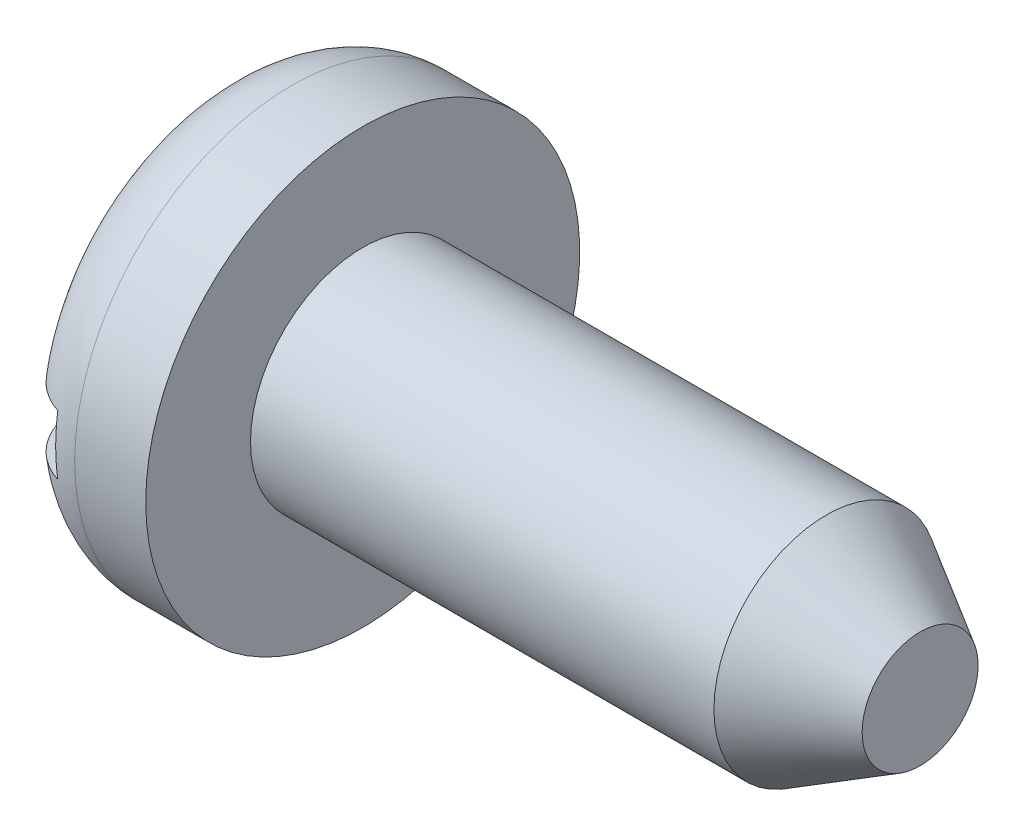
ISO-10303-21;
HEADER;
FILE_DESCRIPTION(('STEP AP214'),'2;1');
FILE_NAME('part.step','',(''),(''),'','','');
FILE_SCHEMA(('AUTOMOTIVE_DESIGN { 1 0 10303 214 1 1 1 1 }'));
ENDSEC;
DATA;
#1=APPLICATION_CONTEXT('core data for automotive mechanical design processes');
#2=APPLICATION_PROTOCOL_DEFINITION('international standard','automotive_design',2000,#1);
#3=PRODUCT_CONTEXT('',#1,'mechanical');
#4=PRODUCT('Part','Part','',(#3));
#5=PRODUCT_RELATED_PRODUCT_CATEGORY('part','',(#4));
#6=PRODUCT_DEFINITION_FORMATION('','',#4);
#7=PRODUCT_DEFINITION_CONTEXT('part definition',#1,'design');
#8=PRODUCT_DEFINITION('design','',#6,#7);
#9=PRODUCT_DEFINITION_SHAPE('','',#8);
#10=(LENGTH_UNIT() NAMED_UNIT(*) SI_UNIT(.MILLI.,.METRE.));
#11=(NAMED_UNIT(*) PLANE_ANGLE_UNIT() SI_UNIT($,.RADIAN.));
#12=(NAMED_UNIT(*) SI_UNIT($,.STERADIAN.) SOLID_ANGLE_UNIT());
#13=UNCERTAINTY_MEASURE_WITH_UNIT(LENGTH_MEASURE(1.E-05),#10,'distance_accuracy_value','');
#14=(GEOMETRIC_REPRESENTATION_CONTEXT(3) GLOBAL_UNCERTAINTY_ASSIGNED_CONTEXT((#13)) GLOBAL_UNIT_ASSIGNED_CONTEXT((#10,
#11,#12)) REPRESENTATION_CONTEXT('',''));
#15=CARTESIAN_POINT('',(0.,0.,0.));
#16=DIRECTION('',(0.,0.,1.));
#17=DIRECTION('',(1.,0.,0.));
#18=AXIS2_PLACEMENT_3D('',#15,#16,#17);
#19=CARTESIAN_POINT('',(0.,0.,0.));
#20=DIRECTION('',(-1.,0.,0.));
#21=DIRECTION('',(0.,0.,1.));
#22=AXIS2_PLACEMENT_3D('',#19,#20,#21);
#23=CYLINDRICAL_SURFACE('',#22,0.762);
#24=CARTESIAN_POINT('',(0.9906,0.,0.));
#25=DIRECTION('',(-1.,0.,0.));
#26=DIRECTION('',(0.,0.,1.));
#27=AXIS2_PLACEMENT_3D('',#24,#25,#26);
#28=CIRCLE('',#27,0.762);
#29=CARTESIAN_POINT('',(0.9906,0.,0.762));
#30=VERTEX_POINT('',#29);
#31=EDGE_CURVE('E164',#30,#30,#28,.T.);
#32=ORIENTED_EDGE('',*,*,#31,.F.);
#33=EDGE_LOOP('',(#32));
#34=FACE_BOUND('',#33,.T.);
#35=CARTESIAN_POINT('',(4.13728568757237,0.,0.));
#36=DIRECTION('',(-1.,0.,0.));
#37=DIRECTION('',(0.,0.,1.));
#38=AXIS2_PLACEMENT_3D('',#35,#36,#37);
#39=CIRCLE('',#38,0.762);
#40=CARTESIAN_POINT('',(4.13728568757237,0.,0.762));
#41=VERTEX_POINT('',#40);
#42=EDGE_CURVE('E273',#41,#41,#39,.T.);
#43=ORIENTED_EDGE('',*,*,#42,.T.);
#44=EDGE_LOOP('',(#43));
#45=FACE_BOUND('',#44,.T.);
#46=ADVANCED_FACE('F70',(#34,#45),#23,.T.);
#47=CARTESIAN_POINT('',(0.,0.,0.));
#48=DIRECTION('',(1.,0.,0.));
#49=DIRECTION('',(0.,0.,-1.));
#50=AXIS2_PLACEMENT_3D('',#47,#48,#49);
#51=PLANE('',#50);
#52=CARTESIAN_POINT('',(0.,0.,0.));
#53=DIRECTION('',(-1.,0.,0.));
#54=DIRECTION('',(0.,0.,1.));
#55=AXIS2_PLACEMENT_3D('',#52,#53,#54);
#56=CIRCLE('',#55,0.965199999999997);
#57=CARTESIAN_POINT('',(0.,0.2032,0.943568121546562));
#58=VERTEX_POINT('',#57);
#59=CARTESIAN_POINT('',(0.,0.2032,-0.943568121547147));
#60=VERTEX_POINT('',#59);
#61=EDGE_CURVE('E158',#58,#60,#56,.T.);
#62=ORIENTED_EDGE('',*,*,#61,.T.);
#63=DIRECTION('',(0.,0.,1.));
#64=VECTOR('',#63,1.);
#65=CARTESIAN_POINT('',(0.,0.2032,-1.4732));
#66=LINE('',#65,#64);
#67=EDGE_CURVE('E162',#60,#58,#66,.T.);
#68=ORIENTED_EDGE('',*,*,#67,.T.);
#69=EDGE_LOOP('',(#62,#68));
#70=FACE_BOUND('',#69,.T.);
#71=ADVANCED_FACE('F180',(#70),#51,.F.);
#72=CARTESIAN_POINT('',(0.,-0.2032,-0.943568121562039));
#73=VERTEX_POINT('',#72);
#74=CARTESIAN_POINT('',(0.,-0.2032,0.943568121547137));
#75=VERTEX_POINT('',#74);
#76=EDGE_CURVE('E134',#73,#75,#56,.T.);
#77=ORIENTED_EDGE('',*,*,#76,.T.);
#78=DIRECTION('',(0.,0.,1.));
#79=VECTOR('',#78,1.);
#80=CARTESIAN_POINT('',(0.,-0.2032,-1.4732));
#81=LINE('',#80,#79);
#82=EDGE_CURVE('E89',#73,#75,#81,.T.);
#83=ORIENTED_EDGE('',*,*,#82,.F.);
#84=EDGE_LOOP('',(#77,#83));
#85=FACE_BOUND('',#84,.T.);
#86=ADVANCED_FACE('F72',(#85),#51,.F.);
#87=CARTESIAN_POINT('',(0.508,0.,0.));
#88=DIRECTION('',(-1.,0.,0.));
#89=DIRECTION('',(0.,0.,1.));
#90=AXIS2_PLACEMENT_3D('',#87,#88,#89);
#91=TOROIDAL_SURFACE('',#90,0.9652,0.508);
#92=CARTESIAN_POINT('',(0.3556,0.,0.));
#93=DIRECTION('',(1.,0.,0.));
#94=DIRECTION('',(0.,0.,-1.));
#95=AXIS2_PLACEMENT_3D('',#92,#93,#94);
#96=CIRCLE('',#95,1.44980111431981);
#97=CARTESIAN_POINT('',(0.3556,-0.2032,-1.43549051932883));
#98=VERTEX_POINT('',#97);
#99=CARTESIAN_POINT('',(0.3556,0.2032,-1.43549051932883));
#100=VERTEX_POINT('',#99);
#101=EDGE_CURVE('E82',#98,#100,#96,.T.);
#102=ORIENTED_EDGE('',*,*,#101,.T.);
#103=CARTESIAN_POINT('',(0.215329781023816,0.2032,-1.36538301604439));
#104=CARTESIAN_POINT('',(0.191944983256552,0.2032,-1.34871688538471));
#105=CARTESIAN_POINT('',(0.169960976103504,0.2032,-1.33004517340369));
#106=CARTESIAN_POINT('',(0.129435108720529,0.2032,-1.28924702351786));
#107=CARTESIAN_POINT('',(0.110897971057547,0.2032,-1.26711592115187));
#108=CARTESIAN_POINT('',(0.0778104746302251,0.2032,-1.22008418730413));
#109=CARTESIAN_POINT('',(0.0632559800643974,0.2032,-1.19518646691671));
#110=CARTESIAN_POINT('',(0.0384902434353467,0.2032,-1.14332891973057));
#111=CARTESIAN_POINT('',(0.0282778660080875,0.2032,-1.11636963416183));
#112=CARTESIAN_POINT('',(0.0123455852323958,0.2032,-1.06084918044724));
#113=CARTESIAN_POINT('',(0.00667399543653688,0.2032,-1.03227416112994));
#114=CARTESIAN_POINT('',(0.000107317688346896,0.2032,-0.974580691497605));
#115=CARTESIAN_POINT('',(-0.000787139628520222,0.2032,-0.945462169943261));
#116=CARTESIAN_POINT('',(0.00219793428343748,0.2032,-0.886884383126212));
#117=CARTESIAN_POINT('',(0.00617386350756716,0.2032,-0.857430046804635));
#118=CARTESIAN_POINT('',(0.0188922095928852,0.2032,-0.799570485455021));
#119=CARTESIAN_POINT('',(0.027635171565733,0.2032,-0.771165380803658));
#120=CARTESIAN_POINT('',(0.0498738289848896,0.2032,-0.715468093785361));
#121=CARTESIAN_POINT('',(0.063481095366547,0.2032,-0.688220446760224));
#122=CARTESIAN_POINT('',(0.095000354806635,0.2032,-0.636333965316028));
#123=CARTESIAN_POINT('',(0.112913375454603,0.2032,-0.61169575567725));
#124=CARTESIAN_POINT('',(0.152912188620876,0.2032,-0.56532174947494));
#125=CARTESIAN_POINT('',(0.175064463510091,0.2032,-0.543643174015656));
#126=CARTESIAN_POINT('',(0.222778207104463,0.2032,-0.504409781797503));
#127=CARTESIAN_POINT('',(0.248340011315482,0.2032,-0.486855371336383));
#128=CARTESIAN_POINT('',(0.301530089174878,0.2032,-0.457008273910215));
#129=CARTESIAN_POINT('',(0.329089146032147,0.2032,-0.444592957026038));
#130=CARTESIAN_POINT('',(0.386028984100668,0.2032,-0.425113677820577));
#131=CARTESIAN_POINT('',(0.415407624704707,0.2032,-0.418043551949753));
#132=CARTESIAN_POINT('',(0.472201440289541,0.2032,-0.41016003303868));
#133=CARTESIAN_POINT('',(0.499544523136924,0.2032,-0.408825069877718));
#134=CARTESIAN_POINT('',(0.554024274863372,0.2032,-0.411075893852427));
#135=CARTESIAN_POINT('',(0.581160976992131,0.2032,-0.41466087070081));
#136=CARTESIAN_POINT('',(0.632878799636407,0.2032,-0.426162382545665));
#137=CARTESIAN_POINT('',(0.657517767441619,0.2032,-0.433823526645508));
#138=CARTESIAN_POINT('',(0.70529059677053,0.2032,-0.452906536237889));
#139=CARTESIAN_POINT('',(0.728423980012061,0.2032,-0.464329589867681));
#140=CARTESIAN_POINT('',(0.774242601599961,0.2032,-0.491392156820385));
#141=CARTESIAN_POINT('',(0.796788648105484,0.2032,-0.507266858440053));
#142=CARTESIAN_POINT('',(0.839182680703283,0.2032,-0.54228103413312));
#143=CARTESIAN_POINT('',(0.859029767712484,0.2032,-0.561421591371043));
#144=CARTESIAN_POINT('',(0.897266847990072,0.2032,-0.604308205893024));
#145=CARTESIAN_POINT('',(0.915367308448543,0.2032,-0.628313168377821));
#146=CARTESIAN_POINT('',(0.947426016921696,0.2032,-0.678948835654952));
#147=CARTESIAN_POINT('',(0.961383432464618,0.2032,-0.705580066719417));
#148=CARTESIAN_POINT('',(0.98511078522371,0.2032,-0.761607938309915));
#149=CARTESIAN_POINT('',(0.994741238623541,0.2032,-0.791063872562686));
#150=CARTESIAN_POINT('',(1.00884220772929,0.2032,-0.851187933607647));
#151=CARTESIAN_POINT('',(1.01331295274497,0.2032,-0.881856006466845));
#152=CARTESIAN_POINT('',(1.01686801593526,0.2032,-0.943068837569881));
#153=CARTESIAN_POINT('',(1.01602778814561,0.2032,-0.973609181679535));
#154=CARTESIAN_POINT('',(1.00909458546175,0.2032,-1.03408891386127));
#155=CARTESIAN_POINT('',(1.00300227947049,0.2032,-1.06402837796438));
#156=CARTESIAN_POINT('',(0.985908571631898,0.2032,-1.12165762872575));
#157=CARTESIAN_POINT('',(0.97503362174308,0.2032,-1.14938493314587));
#158=CARTESIAN_POINT('',(0.948685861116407,0.2032,-1.20256218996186));
#159=CARTESIAN_POINT('',(0.933213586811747,0.2032,-1.22801240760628));
#160=CARTESIAN_POINT('',(0.89846723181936,0.2032,-1.27535454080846));
#161=CARTESIAN_POINT('',(0.879279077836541,0.2032,-1.29730954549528));
#162=CARTESIAN_POINT('',(0.837441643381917,0.2032,-1.3376286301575));
#163=CARTESIAN_POINT('',(0.814792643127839,0.2032,-1.35599300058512));
#164=CARTESIAN_POINT('',(0.767025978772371,0.2032,-1.38834234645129));
#165=CARTESIAN_POINT('',(0.741947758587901,0.2032,-1.40238558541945));
#166=CARTESIAN_POINT('',(0.689776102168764,0.2032,-1.42602105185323));
#167=CARTESIAN_POINT('',(0.662682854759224,0.2032,-1.43561369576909));
#168=CARTESIAN_POINT('',(0.607495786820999,0.2032,-1.45000048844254));
#169=CARTESIAN_POINT('',(0.579412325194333,0.2032,-1.45483440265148));
#170=CARTESIAN_POINT('',(0.522824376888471,0.2032,-1.4597015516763));
#171=CARTESIAN_POINT('',(0.494319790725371,0.2032,-1.45973363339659));
#172=CARTESIAN_POINT('',(0.437799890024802,0.2032,-1.45500220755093));
#173=CARTESIAN_POINT('',(0.409783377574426,0.2032,-1.45025288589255));
#174=CARTESIAN_POINT('',(0.354970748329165,0.2032,-1.4361218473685));
#175=CARTESIAN_POINT('',(0.328173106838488,0.2032,-1.42674610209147));
#176=CARTESIAN_POINT('',(0.287078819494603,0.2032,-1.40837034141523));
#177=CARTESIAN_POINT('',(0.272138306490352,0.2032,-1.40077440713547));
#178=CARTESIAN_POINT('',(0.24308296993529,0.2032,-1.38414070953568));
#179=CARTESIAN_POINT('',(0.228968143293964,0.2032,-1.37510295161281));
#180=CARTESIAN_POINT('',(0.215329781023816,0.2032,-1.36538301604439));
#181=B_SPLINE_CURVE_WITH_KNOTS('',3,(#103,#104,#105,#106,#107,#108,#109,#110,#111,#112,#113,
#114,#115,#116,#117,#118,#119,#120,#121,#122,#123,#124,#125,#126,#127,#128,#129,#130,#131,#132,
#133,#134,#135,#136,#137,#138,#139,#140,#141,#142,#143,#144,#145,#146,#147,#148,#149,#150,#151,
#152,#153,#154,#155,#156,#157,#158,#159,#160,#161,#162,#163,#164,#165,#166,#167,#168,#169,#170,
#171,#172,#173,#174,#175,#176,#177,#178,#179,#180),.UNSPECIFIED.,.T.,.F.,(4,2,2,2,2,2,2,2,2,2,2,
2,2,2,2,2,2,2,2,2,2,2,2,2,2,2,2,2,2,2,2,2,2,2,2,2,2,2,4),(0.,0.0860858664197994,
0.172288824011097,0.258401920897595,0.344492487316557,0.431487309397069,0.518493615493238,
0.607250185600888,0.696016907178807,0.786966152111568,0.877937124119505,0.970473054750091,
1.0630180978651,1.15320598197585,1.24328971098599,1.3249802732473,1.40665738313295,
1.48373329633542,1.56083357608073,1.64321408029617,1.72562196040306,1.81540769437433,
1.90521145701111,1.99773250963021,2.09024945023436,2.18145496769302,2.27264887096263,
2.36156438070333,2.45046951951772,2.53752232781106,2.62456809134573,2.71038278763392,
2.79618945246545,2.88127284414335,2.96637666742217,3.05122873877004,3.13597157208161,
3.18617831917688,3.23638487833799),.UNSPECIFIED.);
#182=EDGE_CURVE('E43',#100,#60,#181,.T.);
#183=ORIENTED_EDGE('',*,*,#182,.T.);
#184=ORIENTED_EDGE('',*,*,#61,.F.);
#185=CARTESIAN_POINT('',(0.329869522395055,0.2032,0.445281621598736));
#186=CARTESIAN_POINT('',(0.301388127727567,0.2032,0.457004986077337));
#187=CARTESIAN_POINT('',(0.273974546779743,0.2032,0.471423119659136));
#188=CARTESIAN_POINT('',(0.22208540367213,0.2032,0.504890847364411));
#189=CARTESIAN_POINT('',(0.197617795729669,0.2032,0.523952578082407));
#190=CARTESIAN_POINT('',(0.153596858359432,0.2032,0.564745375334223));
#191=CARTESIAN_POINT('',(0.133841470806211,0.2032,0.586259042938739));
#192=CARTESIAN_POINT('',(0.0979993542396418,0.2032,0.632122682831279));
#193=CARTESIAN_POINT('',(0.0819099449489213,0.2032,0.656470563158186));
#194=CARTESIAN_POINT('',(0.0529638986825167,0.2032,0.708889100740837));
#195=CARTESIAN_POINT('',(0.0403491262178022,0.2032,0.737093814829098));
#196=CARTESIAN_POINT('',(0.0200538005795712,0.2032,0.795235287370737));
#197=CARTESIAN_POINT('',(0.0123744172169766,0.2032,0.825172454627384));
#198=CARTESIAN_POINT('',(0.00226364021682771,0.2032,0.885780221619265));
#199=CARTESIAN_POINT('',(-0.00019208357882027,0.2032,0.916446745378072));
#200=CARTESIAN_POINT('',(0.000215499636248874,0.2032,0.977744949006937));
#201=CARTESIAN_POINT('',(0.00307803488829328,0.2032,1.00837663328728));
#202=CARTESIAN_POINT('',(0.0139659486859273,0.2032,1.06794438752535));
#203=CARTESIAN_POINT('',(0.0218650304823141,0.2032,1.09690353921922));
#204=CARTESIAN_POINT('',(0.0425262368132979,0.2032,1.15303253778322));
#205=CARTESIAN_POINT('',(0.0552877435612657,0.2032,1.18020261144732));
#206=CARTESIAN_POINT('',(0.084988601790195,0.2032,1.23132857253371));
#207=CARTESIAN_POINT('',(0.101826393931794,0.2032,1.25534348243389));
#208=CARTESIAN_POINT('',(0.139356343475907,0.2032,1.30014514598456));
#209=CARTESIAN_POINT('',(0.160048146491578,0.2032,1.32093219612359));
#210=CARTESIAN_POINT('',(0.204331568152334,0.2032,1.35833837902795));
#211=CARTESIAN_POINT('',(0.227870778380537,0.2032,1.37501957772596));
#212=CARTESIAN_POINT('',(0.277438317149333,0.2032,1.4041461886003));
#213=CARTESIAN_POINT('',(0.303466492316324,0.2032,1.41659186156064));
#214=CARTESIAN_POINT('',(0.356990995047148,0.2032,1.43677120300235));
#215=CARTESIAN_POINT('',(0.384470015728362,0.2032,1.44455079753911));
#216=CARTESIAN_POINT('',(0.440346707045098,0.2032,1.45536093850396));
#217=CARTESIAN_POINT('',(0.468744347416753,0.2032,1.4583916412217));
#218=CARTESIAN_POINT('',(0.52550374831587,0.2032,1.45961107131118));
#219=CARTESIAN_POINT('',(0.553865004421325,0.2032,1.45782341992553));
#220=CARTESIAN_POINT('',(0.609883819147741,0.2032,1.44950941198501));
#221=CARTESIAN_POINT('',(0.637541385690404,0.2032,1.4429831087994));
#222=CARTESIAN_POINT('',(0.691357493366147,0.2032,1.42538788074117));
#223=CARTESIAN_POINT('',(0.717516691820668,0.2032,1.41432096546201));
#224=CARTESIAN_POINT('',(0.767615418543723,0.2032,1.38796878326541));
#225=CARTESIAN_POINT('',(0.79155492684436,0.2032,1.3726834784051));
#226=CARTESIAN_POINT('',(0.836640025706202,0.2032,1.33827130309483));
#227=CARTESIAN_POINT('',(0.857774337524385,0.2032,1.3191296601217));
#228=CARTESIAN_POINT('',(0.896562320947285,0.2032,1.277597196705));
#229=CARTESIAN_POINT('',(0.914215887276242,0.2032,1.25520627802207));
#230=CARTESIAN_POINT('',(0.945713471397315,0.2032,1.20760814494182));
#231=CARTESIAN_POINT('',(0.959523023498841,0.2032,1.1823781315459));
#232=CARTESIAN_POINT('',(0.982777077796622,0.2032,1.12998246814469));
#233=CARTESIAN_POINT('',(0.99222134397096,0.2032,1.10281671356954));
#234=CARTESIAN_POINT('',(1.00663194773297,0.2032,1.04690763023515));
#235=CARTESIAN_POINT('',(1.0115321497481,0.2032,1.01814726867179));
#236=CARTESIAN_POINT('',(1.01653829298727,0.2032,0.960213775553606));
#237=CARTESIAN_POINT('',(1.0166437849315,0.2032,0.931040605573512));
#238=CARTESIAN_POINT('',(1.0120686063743,0.2032,0.872467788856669));
#239=CARTESIAN_POINT('',(1.00728924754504,0.2032,0.84307586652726));
#240=CARTESIAN_POINT('',(0.992985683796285,0.2032,0.785471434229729));
#241=CARTESIAN_POINT('',(0.98346091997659,0.2032,0.757259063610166));
#242=CARTESIAN_POINT('',(0.95967909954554,0.2032,0.702076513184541));
#243=CARTESIAN_POINT('',(0.945311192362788,0.2032,0.67515408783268));
#244=CARTESIAN_POINT('',(0.912326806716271,0.2032,0.624042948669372));
#245=CARTESIAN_POINT('',(0.89370918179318,0.2032,0.599854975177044));
#246=CARTESIAN_POINT('',(0.852394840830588,0.2032,0.554555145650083));
#247=CARTESIAN_POINT('',(0.829639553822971,0.2032,0.533496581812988));
#248=CARTESIAN_POINT('',(0.78081955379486,0.2032,0.495627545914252));
#249=CARTESIAN_POINT('',(0.754755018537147,0.2032,0.478816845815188));
#250=CARTESIAN_POINT('',(0.700850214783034,0.2032,0.450647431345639));
#251=CARTESIAN_POINT('',(0.673090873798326,0.2032,0.43913478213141));
#252=CARTESIAN_POINT('',(0.615907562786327,0.2032,0.421501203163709));
#253=CARTESIAN_POINT('',(0.586484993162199,0.2032,0.415375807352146));
#254=CARTESIAN_POINT('',(0.529860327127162,0.2032,0.409286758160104));
#255=CARTESIAN_POINT('',(0.502714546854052,0.2032,0.408790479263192));
#256=CARTESIAN_POINT('',(0.448794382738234,0.2032,0.412621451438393));
#257=CARTESIAN_POINT('',(0.422019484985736,0.2032,0.416941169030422));
#258=CARTESIAN_POINT('',(0.38460048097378,0.2032,0.426332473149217));
#259=CARTESIAN_POINT('',(0.373465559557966,0.2032,0.429570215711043));
#260=CARTESIAN_POINT('',(0.351459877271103,0.2032,0.436838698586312));
#261=CARTESIAN_POINT('',(0.340589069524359,0.2032,0.440869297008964));
#262=CARTESIAN_POINT('',(0.329869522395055,0.2032,0.445281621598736));
#263=B_SPLINE_CURVE_WITH_KNOTS('',3,(#185,#186,#187,#188,#189,#190,#191,#192,#193,#194,#195,
#196,#197,#198,#199,#200,#201,#202,#203,#204,#205,#206,#207,#208,#209,#210,#211,#212,#213,#214,
#215,#216,#217,#218,#219,#220,#221,#222,#223,#224,#225,#226,#227,#228,#229,#230,#231,#232,#233,
#234,#235,#236,#237,#238,#239,#240,#241,#242,#243,#244,#245,#246,#247,#248,#249,#250,#251,#252,
#253,#254,#255,#256,#257,#258,#259,#260,#261,#262),.UNSPECIFIED.,.T.,.F.,(4,2,2,2,2,2,2,2,2,2,2,
2,2,2,2,2,2,2,2,2,2,2,2,2,2,2,2,2,2,2,2,2,2,2,2,2,2,2,4),(0.,0.0923499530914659,
0.184943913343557,0.272196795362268,0.359385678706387,0.451635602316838,0.543907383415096,
0.635748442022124,0.727576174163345,0.817187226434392,0.906786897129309,0.994349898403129,
1.08190485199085,1.16804138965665,1.25417262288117,1.33944156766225,1.42470770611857,
1.50955660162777,1.59440454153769,1.67921496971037,1.76402616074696,1.84916863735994,
1.93431368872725,2.02019922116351,2.10608939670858,2.19321087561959,2.28034051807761,
2.36926591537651,2.45820178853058,2.54932966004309,2.64048214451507,2.7330427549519,
2.82559839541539,2.915262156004,3.0048515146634,3.08588429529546,3.16679049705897,
3.20155447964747,3.23631224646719),.UNSPECIFIED.);
#264=CARTESIAN_POINT('',(0.3556,0.2032,1.43549051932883));
#265=VERTEX_POINT('',#264);
#266=EDGE_CURVE('E97',#58,#265,#263,.T.);
#267=ORIENTED_EDGE('',*,*,#266,.T.);
#268=CARTESIAN_POINT('',(0.3556,-0.2032,1.43549051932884));
#269=VERTEX_POINT('',#268);
#270=EDGE_CURVE('E126',#265,#269,#96,.T.);
#271=ORIENTED_EDGE('',*,*,#270,.T.);
#272=CARTESIAN_POINT('',(0.329869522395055,-0.2032,0.445281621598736));
#273=CARTESIAN_POINT('',(0.358502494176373,-0.2032,0.433499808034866));
#274=CARTESIAN_POINT('',(0.388290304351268,-0.2032,0.424410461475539));
#275=CARTESIAN_POINT('',(0.449099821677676,-0.2032,0.412341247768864));
#276=CARTESIAN_POINT('',(0.480121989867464,-0.2032,0.409363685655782));
#277=CARTESIAN_POINT('',(0.53746599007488,-0.2032,0.409751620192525));
#278=CARTESIAN_POINT('',(0.563796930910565,-0.2032,0.412235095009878));
#279=CARTESIAN_POINT('',(0.615642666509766,-0.2032,0.421635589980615));
#280=CARTESIAN_POINT('',(0.64115766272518,-0.2032,0.42855150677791));
#281=CARTESIAN_POINT('',(0.690499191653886,-0.2032,0.446345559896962));
#282=CARTESIAN_POINT('',(0.714338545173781,-0.2032,0.457188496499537));
#283=CARTESIAN_POINT('',(0.760081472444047,-0.2032,0.482384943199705));
#284=CARTESIAN_POINT('',(0.781984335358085,-0.2032,0.496739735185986));
#285=CARTESIAN_POINT('',(0.825382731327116,-0.2032,0.529991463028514));
#286=CARTESIAN_POINT('',(0.846649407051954,-0.2032,0.549187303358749));
#287=CARTESIAN_POINT('',(0.885922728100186,-0.2032,0.590667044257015));
#288=CARTESIAN_POINT('',(0.903928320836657,-0.2032,0.612951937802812));
#289=CARTESIAN_POINT('',(0.937387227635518,-0.2032,0.661679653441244));
#290=CARTESIAN_POINT('',(0.952577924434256,-0.2032,0.688303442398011));
#291=CARTESIAN_POINT('',(0.978319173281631,-0.2032,0.743709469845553));
#292=CARTESIAN_POINT('',(0.988869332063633,-0.2032,0.772491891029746));
#293=CARTESIAN_POINT('',(1.00504837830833,-0.2032,0.831670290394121));
#294=CARTESIAN_POINT('',(1.01063569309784,-0.2032,0.862077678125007));
#295=CARTESIAN_POINT('',(1.01650465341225,-0.2032,0.923401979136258));
#296=CARTESIAN_POINT('',(1.01678678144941,-0.2032,0.954318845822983));
#297=CARTESIAN_POINT('',(1.01202058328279,-0.2032,1.01507018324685));
#298=CARTESIAN_POINT('',(1.00708687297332,-0.2032,1.04491362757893));
#299=CARTESIAN_POINT('',(0.992152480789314,-0.2032,1.10330552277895));
#300=CARTESIAN_POINT('',(0.982152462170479,-0.2032,1.13185414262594));
#301=CARTESIAN_POINT('',(0.957639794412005,-0.2032,1.18611286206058));
#302=CARTESIAN_POINT('',(0.943242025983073,-0.2032,1.21187488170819));
#303=CARTESIAN_POINT('',(0.910249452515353,-0.2032,1.26055500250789));
#304=CARTESIAN_POINT('',(0.891655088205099,-0.2032,1.28347340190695));
#305=CARTESIAN_POINT('',(0.851169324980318,-0.2032,1.32537967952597));
#306=CARTESIAN_POINT('',(0.829344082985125,-0.2032,1.34443149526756));
#307=CARTESIAN_POINT('',(0.782772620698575,-0.2032,1.37854814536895));
#308=CARTESIAN_POINT('',(0.758026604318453,-0.2032,1.39361325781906));
#309=CARTESIAN_POINT('',(0.706631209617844,-0.2032,1.41915051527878));
#310=CARTESIAN_POINT('',(0.680007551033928,-0.2032,1.42967444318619));
#311=CARTESIAN_POINT('',(0.625364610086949,-0.2032,1.44607110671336));
#312=CARTESIAN_POINT('',(0.597345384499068,-0.2032,1.45194403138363));
#313=CARTESIAN_POINT('',(0.540896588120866,-0.2032,1.4588417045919));
#314=CARTESIAN_POINT('',(0.51247072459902,-0.2032,1.45989682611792));
#315=CARTESIAN_POINT('',(0.455846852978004,-0.2032,1.45721066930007));
#316=CARTESIAN_POINT('',(0.427648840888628,-0.2032,1.45346947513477));
#317=CARTESIAN_POINT('',(0.372330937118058,-0.2032,1.44131185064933));
#318=CARTESIAN_POINT('',(0.34520927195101,-0.2032,1.43290348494));
#319=CARTESIAN_POINT('',(0.29275745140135,-0.2032,1.41166409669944));
#320=CARTESIAN_POINT('',(0.267427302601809,-0.2032,1.39883305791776));
#321=CARTESIAN_POINT('',(0.219202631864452,-0.2032,1.36908393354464));
#322=CARTESIAN_POINT('',(0.196314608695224,-0.2032,1.352155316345));
#323=CARTESIAN_POINT('',(0.153680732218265,-0.2032,1.31472098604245));
#324=CARTESIAN_POINT('',(0.133934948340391,-0.2032,1.29421519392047));
#325=CARTESIAN_POINT('',(0.09798669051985,-0.2032,1.25005655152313));
#326=CARTESIAN_POINT('',(0.0818107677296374,-0.2032,1.22638209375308));
#327=CARTESIAN_POINT('',(0.0536071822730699,-0.2032,1.17668070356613));
#328=CARTESIAN_POINT('',(0.0415797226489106,-0.2032,1.15065365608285));
#329=CARTESIAN_POINT('',(0.0218430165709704,-0.2032,1.0966403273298));
#330=CARTESIAN_POINT('',(0.0141899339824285,-0.2032,1.06863353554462));
#331=CARTESIAN_POINT('',(0.00360096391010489,-0.2032,1.01174340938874));
#332=CARTESIAN_POINT('',(0.00066547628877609,-0.2032,0.982860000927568));
#333=CARTESIAN_POINT('',(-0.000473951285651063,-0.2032,0.924457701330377));
#334=CARTESIAN_POINT('',(0.00141209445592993,-0.2032,0.89493707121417));
#335=CARTESIAN_POINT('',(0.0099926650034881,-0.2032,0.836606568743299));
#336=CARTESIAN_POINT('',(0.0166874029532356,-0.2032,0.807796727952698));
#337=CARTESIAN_POINT('',(0.0348652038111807,-0.2032,0.75096878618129));
#338=CARTESIAN_POINT('',(0.0464589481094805,-0.2032,0.722986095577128));
#339=CARTESIAN_POINT('',(0.0740900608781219,-0.2032,0.669288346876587));
#340=CARTESIAN_POINT('',(0.0901302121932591,-0.2032,0.643574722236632));
#341=CARTESIAN_POINT('',(0.126599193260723,-0.2032,0.594601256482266));
#342=CARTESIAN_POINT('',(0.14711543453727,-0.2032,0.571406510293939));
#343=CARTESIAN_POINT('',(0.19176560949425,-0.2032,0.528864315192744));
#344=CARTESIAN_POINT('',(0.215892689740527,-0.2032,0.509509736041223));
#345=CARTESIAN_POINT('',(0.255421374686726,-0.2032,0.483159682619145));
#346=CARTESIAN_POINT('',(0.269772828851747,-0.2032,0.474557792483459));
#347=CARTESIAN_POINT('',(0.299259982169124,-0.2032,0.458801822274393));
#348=CARTESIAN_POINT('',(0.314396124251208,-0.2032,0.45164857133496));
#349=CARTESIAN_POINT('',(0.329869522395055,-0.2032,0.445281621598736));
#350=B_SPLINE_CURVE_WITH_KNOTS('',3,(#272,#273,#274,#275,#276,#277,#278,#279,#280,#281,#282,
#283,#284,#285,#286,#287,#288,#289,#290,#291,#292,#293,#294,#295,#296,#297,#298,#299,#300,#301,
#302,#303,#304,#305,#306,#307,#308,#309,#310,#311,#312,#313,#314,#315,#316,#317,#318,#319,#320,
#321,#322,#323,#324,#325,#326,#327,#328,#329,#330,#331,#332,#333,#334,#335,#336,#337,#338,#339,
#340,#341,#342,#343,#344,#345,#346,#347,#348,#349),.UNSPECIFIED.,.T.,.F.,(4,2,2,2,2,2,2,2,2,2,2,
2,2,2,2,2,2,2,2,2,2,2,2,2,2,2,2,2,2,2,2,2,2,2,2,2,2,2,4),(0.,0.0928052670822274,0.1856455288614,
0.264601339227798,0.3435375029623,0.421782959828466,0.500057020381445,0.585637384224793,
0.671245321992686,0.762773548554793,0.854309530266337,0.946605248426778,1.03889257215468,
1.12919326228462,1.21948213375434,1.30758929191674,1.39568720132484,1.48218191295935,
1.56867058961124,1.65414515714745,1.73961625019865,1.82454775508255,1.90947776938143,
1.99426148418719,2.07904551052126,2.16404980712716,2.24905598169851,2.3346745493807,
2.4202973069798,2.50699603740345,2.59370211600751,2.68203818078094,2.77037816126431,
2.860830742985,2.9513400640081,3.04380682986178,3.13610026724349,3.18622408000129,
3.23637650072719),.UNSPECIFIED.);
#351=EDGE_CURVE('E128',#269,#75,#350,.T.);
#352=ORIENTED_EDGE('',*,*,#351,.T.);
#353=ORIENTED_EDGE('',*,*,#76,.F.);
#354=CARTESIAN_POINT('',(0.215329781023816,-0.2032,-1.36538301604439));
#355=CARTESIAN_POINT('',(0.238413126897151,-0.2032,-1.38183109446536));
#356=CARTESIAN_POINT('',(0.262895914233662,-0.2032,-1.39635027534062));
#357=CARTESIAN_POINT('',(0.313970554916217,-0.2032,-1.42108757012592));
#358=CARTESIAN_POINT('',(0.340564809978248,-0.2032,-1.4313007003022));
#359=CARTESIAN_POINT('',(0.395087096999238,-0.2032,-1.44710688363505));
#360=CARTESIAN_POINT('',(0.423014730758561,-0.2032,-1.4527013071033));
#361=CARTESIAN_POINT('',(0.479406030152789,-0.2032,-1.45910641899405));
#362=CARTESIAN_POINT('',(0.507869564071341,-0.2032,-1.45991826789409));
#363=CARTESIAN_POINT('',(0.564455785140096,-0.2032,-1.45674197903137));
#364=CARTESIAN_POINT('',(0.592579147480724,-0.2032,-1.45276585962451));
#365=CARTESIAN_POINT('',(0.647760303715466,-0.2032,-1.4401505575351));
#366=CARTESIAN_POINT('',(0.674818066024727,-0.2032,-1.43151123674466));
#367=CARTESIAN_POINT('',(0.727117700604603,-0.2032,-1.40981738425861));
#368=CARTESIAN_POINT('',(0.752358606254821,-0.2032,-1.39676052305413));
#369=CARTESIAN_POINT('',(0.800303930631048,-0.2032,-1.3666142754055));
#370=CARTESIAN_POINT('',(0.823008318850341,-0.2032,-1.34952484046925));
#371=CARTESIAN_POINT('',(0.86536223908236,-0.2032,-1.31171460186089));
#372=CARTESIAN_POINT('',(0.88499609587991,-0.2032,-1.29097624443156));
#373=CARTESIAN_POINT('',(0.920543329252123,-0.2032,-1.2465257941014));
#374=CARTESIAN_POINT('',(0.93645658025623,-0.2032,-1.22281360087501));
#375=CARTESIAN_POINT('',(0.964288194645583,-0.2032,-1.17284246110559));
#376=CARTESIAN_POINT('',(0.976165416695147,-0.2032,-1.14656061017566));
#377=CARTESIAN_POINT('',(0.995414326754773,-0.2032,-1.09239735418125));
#378=CARTESIAN_POINT('',(1.00278573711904,-0.2032,-1.06451585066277));
#379=CARTESIAN_POINT('',(1.01294858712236,-0.2032,-1.00747782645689));
#380=CARTESIAN_POINT('',(1.01566604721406,-0.2032,-0.978308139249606));
#381=CARTESIAN_POINT('',(1.01627607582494,-0.2032,-0.919919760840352));
#382=CARTESIAN_POINT('',(1.01416814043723,-0.2032,-0.890701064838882));
#383=CARTESIAN_POINT('',(1.00514471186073,-0.2032,-0.832359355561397));
#384=CARTESIAN_POINT('',(0.998124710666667,-0.2032,-0.803252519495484));
#385=CARTESIAN_POINT('',(0.979416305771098,-0.2032,-0.746580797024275));
#386=CARTESIAN_POINT('',(0.967727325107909,-0.2032,-0.719016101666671));
#387=CARTESIAN_POINT('',(0.939693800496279,-0.2032,-0.665502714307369));
#388=CARTESIAN_POINT('',(0.923242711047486,-0.2032,-0.639609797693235));
#389=CARTESIAN_POINT('',(0.886263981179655,-0.2032,-0.590906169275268));
#390=CARTESIAN_POINT('',(0.865735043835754,-0.2032,-0.56809644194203));
#391=CARTESIAN_POINT('',(0.820921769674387,-0.2032,-0.526066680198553));
#392=CARTESIAN_POINT('',(0.796605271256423,-0.2032,-0.506880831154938));
#393=CARTESIAN_POINT('',(0.744964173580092,-0.2032,-0.473090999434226));
#394=CARTESIAN_POINT('',(0.717640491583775,-0.2032,-0.458485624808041));
#395=CARTESIAN_POINT('',(0.662102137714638,-0.2032,-0.435191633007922));
#396=CARTESIAN_POINT('',(0.633993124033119,-0.2032,-0.426252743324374));
#397=CARTESIAN_POINT('',(0.57660622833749,-0.2032,-0.413819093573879));
#398=CARTESIAN_POINT('',(0.547329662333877,-0.2032,-0.410318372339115));
#399=CARTESIAN_POINT('',(0.49156776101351,-0.2032,-0.409090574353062));
#400=CARTESIAN_POINT('',(0.465092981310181,-0.2032,-0.410826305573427));
#401=CARTESIAN_POINT('',(0.412832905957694,-0.2032,-0.418808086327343));
#402=CARTESIAN_POINT('',(0.38704772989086,-0.2032,-0.425054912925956));
#403=CARTESIAN_POINT('',(0.337286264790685,-0.2032,-0.44154946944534));
#404=CARTESIAN_POINT('',(0.313286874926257,-0.2032,-0.451728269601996));
#405=CARTESIAN_POINT('',(0.267133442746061,-0.2032,-0.475639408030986));
#406=CARTESIAN_POINT('',(0.244979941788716,-0.2032,-0.489372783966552));
#407=CARTESIAN_POINT('',(0.201037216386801,-0.2032,-0.521321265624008));
#408=CARTESIAN_POINT('',(0.179460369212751,-0.2032,-0.539828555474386));
#409=CARTESIAN_POINT('',(0.139446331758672,-0.2032,-0.579973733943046));
#410=CARTESIAN_POINT('',(0.121010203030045,-0.2032,-0.601612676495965));
#411=CARTESIAN_POINT('',(0.0864520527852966,-0.2032,-0.649175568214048));
#412=CARTESIAN_POINT('',(0.0706024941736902,-0.2032,-0.675298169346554));
#413=CARTESIAN_POINT('',(0.0434482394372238,-0.2032,-0.729810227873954));
#414=CARTESIAN_POINT('',(0.0321440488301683,-0.2032,-0.758199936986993));
#415=CARTESIAN_POINT('',(0.0143320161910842,-0.2032,-0.816838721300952));
#416=CARTESIAN_POINT('',(0.00788572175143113,-0.2032,-0.847106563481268));
#417=CARTESIAN_POINT('',(0.000281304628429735,-0.2032,-0.908299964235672));
#418=CARTESIAN_POINT('',(-0.000877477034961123,-0.2032,-0.939225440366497));
#419=CARTESIAN_POINT('',(0.00216442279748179,-0.2032,-1.0001769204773));
#420=CARTESIAN_POINT('',(0.00625570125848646,-0.2032,-1.0302083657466));
#421=CARTESIAN_POINT('',(0.0195535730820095,-0.2032,-1.08912663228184));
#422=CARTESIAN_POINT('',(0.0287608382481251,-0.2032,-1.11801330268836));
#423=CARTESIAN_POINT('',(0.0517804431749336,-0.2032,-1.17307269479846));
#424=CARTESIAN_POINT('',(0.0654771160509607,-0.2032,-1.19929387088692));
#425=CARTESIAN_POINT('',(0.0971505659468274,-0.2032,-1.24897777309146));
#426=CARTESIAN_POINT('',(0.115121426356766,-0.2032,-1.27244424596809));
#427=CARTESIAN_POINT('',(0.147055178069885,-0.2032,-1.3074173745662));
#428=CARTESIAN_POINT('',(0.159843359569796,-0.2032,-1.32001628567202));
#429=CARTESIAN_POINT('',(0.18667752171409,-0.2032,-1.34379523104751));
#430=CARTESIAN_POINT('',(0.200723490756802,-0.2032,-1.3549752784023));
#431=CARTESIAN_POINT('',(0.215329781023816,-0.2032,-1.36538301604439));
#432=B_SPLINE_CURVE_WITH_KNOTS('',3,(#354,#355,#356,#357,#358,#359,#360,#361,#362,#363,#364,
#365,#366,#367,#368,#369,#370,#371,#372,#373,#374,#375,#376,#377,#378,#379,#380,#381,#382,#383,
#384,#385,#386,#387,#388,#389,#390,#391,#392,#393,#394,#395,#396,#397,#398,#399,#400,#401,#402,
#403,#404,#405,#406,#407,#408,#409,#410,#411,#412,#413,#414,#415,#416,#417,#418,#419,#420,#421,
#422,#423,#424,#425,#426,#427,#428,#429,#430,#431),.UNSPECIFIED.,.T.,.F.,(4,2,2,2,2,2,2,2,2,2,2,
2,2,2,2,2,2,2,2,2,2,2,2,2,2,2,2,2,2,2,2,2,2,2,2,2,2,2,4),(0.,0.0849667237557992,
0.170031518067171,0.255071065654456,0.340089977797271,0.424895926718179,0.509704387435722,
0.594557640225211,0.679411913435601,0.764686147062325,0.84996325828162,0.93608525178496,
1.02221255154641,1.10969665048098,1.19718988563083,1.28660355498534,1.3760282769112,
1.4676329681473,1.55926684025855,1.6517261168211,1.74415726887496,1.83215338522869,
1.9200529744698,1.99925203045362,2.07846473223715,2.15634757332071,2.23425317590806,
2.31917295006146,2.40412137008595,2.49536039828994,2.58660957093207,2.6789962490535,
2.77137141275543,2.86185252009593,2.95234551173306,3.04066950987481,3.12887194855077,
3.18263625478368,3.2364000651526),.UNSPECIFIED.);
#433=EDGE_CURVE('E124',#73,#98,#432,.T.);
#434=ORIENTED_EDGE('',*,*,#433,.T.);
#435=EDGE_LOOP('',(#102,#183,#184,#267,#271,#352,#353,#434));
#436=FACE_BOUND('',#435,.T.);
#437=CARTESIAN_POINT('',(0.508000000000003,0.,0.));
#438=DIRECTION('',(-1.,0.,0.));
#439=DIRECTION('',(0.,0.,1.));
#440=AXIS2_PLACEMENT_3D('',#437,#438,#439);
#441=CIRCLE('',#440,1.4732);
#442=CARTESIAN_POINT('',(0.508000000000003,0.,1.4732));
#443=VERTEX_POINT('',#442);
#444=EDGE_CURVE('E174',#443,#443,#441,.T.);
#445=ORIENTED_EDGE('',*,*,#444,.T.);
#446=EDGE_LOOP('',(#445));
#447=FACE_BOUND('',#446,.T.);
#448=ADVANCED_FACE('F131',(#436,#447),#91,.T.);
#449=CARTESIAN_POINT('',(0.,0.,0.));
#450=DIRECTION('',(-1.,0.,0.));
#451=DIRECTION('',(0.,0.,1.));
#452=AXIS2_PLACEMENT_3D('',#449,#450,#451);
#453=CYLINDRICAL_SURFACE('',#452,1.4732);
#454=ORIENTED_EDGE('',*,*,#444,.F.);
#455=EDGE_LOOP('',(#454));
#456=FACE_BOUND('',#455,.T.);
#457=CARTESIAN_POINT('',(0.9906,0.,0.));
#458=DIRECTION('',(-1.,0.,0.));
#459=DIRECTION('',(0.,0.,1.));
#460=AXIS2_PLACEMENT_3D('',#457,#458,#459);
#461=CIRCLE('',#460,1.4732);
#462=CARTESIAN_POINT('',(0.9906,0.,1.4732));
#463=VERTEX_POINT('',#462);
#464=EDGE_CURVE('E172',#463,#463,#461,.T.);
#465=ORIENTED_EDGE('',*,*,#464,.T.);
#466=EDGE_LOOP('',(#465));
#467=FACE_BOUND('',#466,.T.);
#468=ADVANCED_FACE('F194',(#456,#467),#453,.T.);
#469=CARTESIAN_POINT('',(0.9906,0.762,0.));
#470=DIRECTION('',(-1.,0.,0.));
#471=DIRECTION('',(0.,0.,1.));
#472=AXIS2_PLACEMENT_3D('',#469,#470,#471);
#473=PLANE('',#472);
#474=ORIENTED_EDGE('',*,*,#464,.F.);
#475=EDGE_LOOP('',(#474));
#476=FACE_BOUND('',#475,.T.);
#477=ORIENTED_EDGE('',*,*,#31,.T.);
#478=EDGE_LOOP('',(#477));
#479=FACE_BOUND('',#478,.T.);
#480=ADVANCED_FACE('F192',(#476,#479),#473,.F.);
#481=CARTESIAN_POINT('',(0.,0.2032,-1.4732));
#482=DIRECTION('',(0.,1.,0.));
#483=DIRECTION('',(0.,0.,1.));
#484=AXIS2_PLACEMENT_3D('',#481,#482,#483);
#485=PLANE('',#484);
#486=DIRECTION('',(0.,0.,1.));
#487=VECTOR('',#486,1.);
#488=CARTESIAN_POINT('',(0.3556,0.2032,-1.4732));
#489=LINE('',#488,#487);
#490=EDGE_CURVE('E121',#100,#265,#489,.T.);
#491=ORIENTED_EDGE('',*,*,#490,.T.);
#492=ORIENTED_EDGE('',*,*,#266,.F.);
#493=ORIENTED_EDGE('',*,*,#67,.F.);
#494=ORIENTED_EDGE('',*,*,#182,.F.);
#495=EDGE_LOOP('',(#491,#492,#493,#494));
#496=FACE_BOUND('',#495,.T.);
#497=ADVANCED_FACE('F161',(#496),#485,.F.);
#498=CARTESIAN_POINT('',(0.3556,0.2032,-1.4732));
#499=DIRECTION('',(1.,0.,0.));
#500=DIRECTION('',(0.,0.,-1.));
#501=AXIS2_PLACEMENT_3D('',#498,#499,#500);
#502=PLANE('',#501);
#503=ORIENTED_EDGE('',*,*,#490,.F.);
#504=ORIENTED_EDGE('',*,*,#101,.F.);
#505=DIRECTION('',(0.,0.,1.));
#506=VECTOR('',#505,1.);
#507=CARTESIAN_POINT('',(0.3556,-0.2032,-1.4732));
#508=LINE('',#507,#506);
#509=EDGE_CURVE('E119',#98,#269,#508,.T.);
#510=ORIENTED_EDGE('',*,*,#509,.T.);
#511=ORIENTED_EDGE('',*,*,#270,.F.);
#512=EDGE_LOOP('',(#503,#504,#510,#511));
#513=FACE_BOUND('',#512,.T.);
#514=ADVANCED_FACE('F118',(#513),#502,.F.);
#515=CARTESIAN_POINT('',(0.,-0.2032,-1.4732));
#516=DIRECTION('',(0.,-1.,0.));
#517=DIRECTION('',(0.,0.,-1.));
#518=AXIS2_PLACEMENT_3D('',#515,#516,#517);
#519=PLANE('',#518);
#520=ORIENTED_EDGE('',*,*,#82,.T.);
#521=ORIENTED_EDGE('',*,*,#351,.F.);
#522=ORIENTED_EDGE('',*,*,#509,.F.);
#523=ORIENTED_EDGE('',*,*,#433,.F.);
#524=EDGE_LOOP('',(#520,#521,#522,#523));
#525=FACE_BOUND('',#524,.T.);
#526=ADVANCED_FACE('F127',(#525),#519,.F.);
#527=CARTESIAN_POINT('',(4.13728568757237,0.,0.));
#528=DIRECTION('',(-1.,0.,0.));
#529=DIRECTION('',(0.,0.,1.));
#530=AXIS2_PLACEMENT_3D('',#527,#528,#529);
#531=CONICAL_SURFACE('',#530,0.762,0.523598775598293);
#532=CARTESIAN_POINT('',(4.7752,0.,0.));
#533=DIRECTION('',(-1.,0.,0.));
#534=DIRECTION('',(0.,0.,1.));
#535=AXIS2_PLACEMENT_3D('',#532,#533,#534);
#536=CIRCLE('',#535,0.3937);
#537=CARTESIAN_POINT('',(4.7752,0.,0.3937));
#538=VERTEX_POINT('',#537);
#539=EDGE_CURVE('E169',#538,#538,#536,.T.);
#540=ORIENTED_EDGE('',*,*,#539,.T.);
#541=EDGE_LOOP('',(#540));
#542=FACE_BOUND('',#541,.T.);
#543=ORIENTED_EDGE('',*,*,#42,.F.);
#544=EDGE_LOOP('',(#543));
#545=FACE_BOUND('',#544,.T.);
#546=ADVANCED_FACE('F149',(#542,#545),#531,.T.);
#547=CARTESIAN_POINT('',(4.7752,0.762,0.));
#548=DIRECTION('',(-1.,0.,0.));
#549=DIRECTION('',(0.,0.,1.));
#550=AXIS2_PLACEMENT_3D('',#547,#548,#549);
#551=PLANE('',#550);
#552=ORIENTED_EDGE('',*,*,#539,.F.);
#553=EDGE_LOOP('',(#552));
#554=FACE_BOUND('',#553,.T.);
#555=ADVANCED_FACE('F150',(#554),#551,.F.);
#556=CLOSED_SHELL('',(#46,#71,#86,#448,#468,#480,#497,#514,#526,#546,#555));
#557=MANIFOLD_SOLID_BREP('B6',#556);
#558=ADVANCED_BREP_SHAPE_REPRESENTATION('',(#18,#557),#14);
#559=SHAPE_DEFINITION_REPRESENTATION(#9,#558);
ENDSEC;
END-ISO-10303-21;
